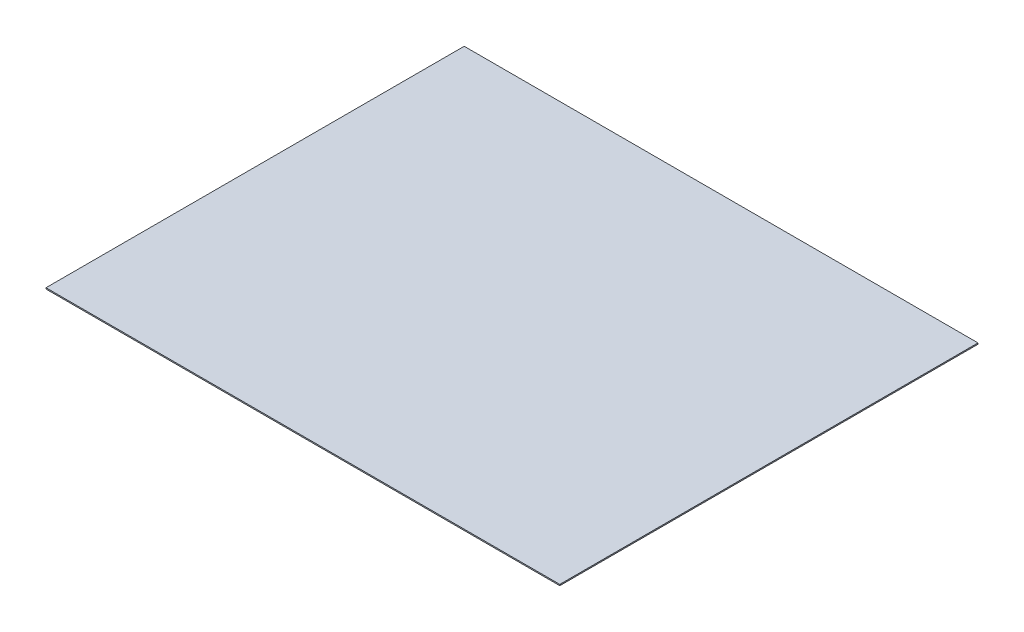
from build123d import *

# Parameters (mm, degrees)
SKETCH1_W           = 546.1
SKETCH1_H           = 444.5
BOSS_EXTRUDE1_DEPTH = 1.27


with BuildPart() as part:
    # Sketch1 → Boss-Extrude1 (new body)
    with BuildSketch(Plane(origin=(0, 0, 0), x_dir=(1, 0, 0), z_dir=(0, 1, 0))):
        with Locations((273.05, -222.25)):
            Rectangle(SKETCH1_W, SKETCH1_H)
    extrude(amount=BOSS_EXTRUDE1_DEPTH)


solid = part.part
